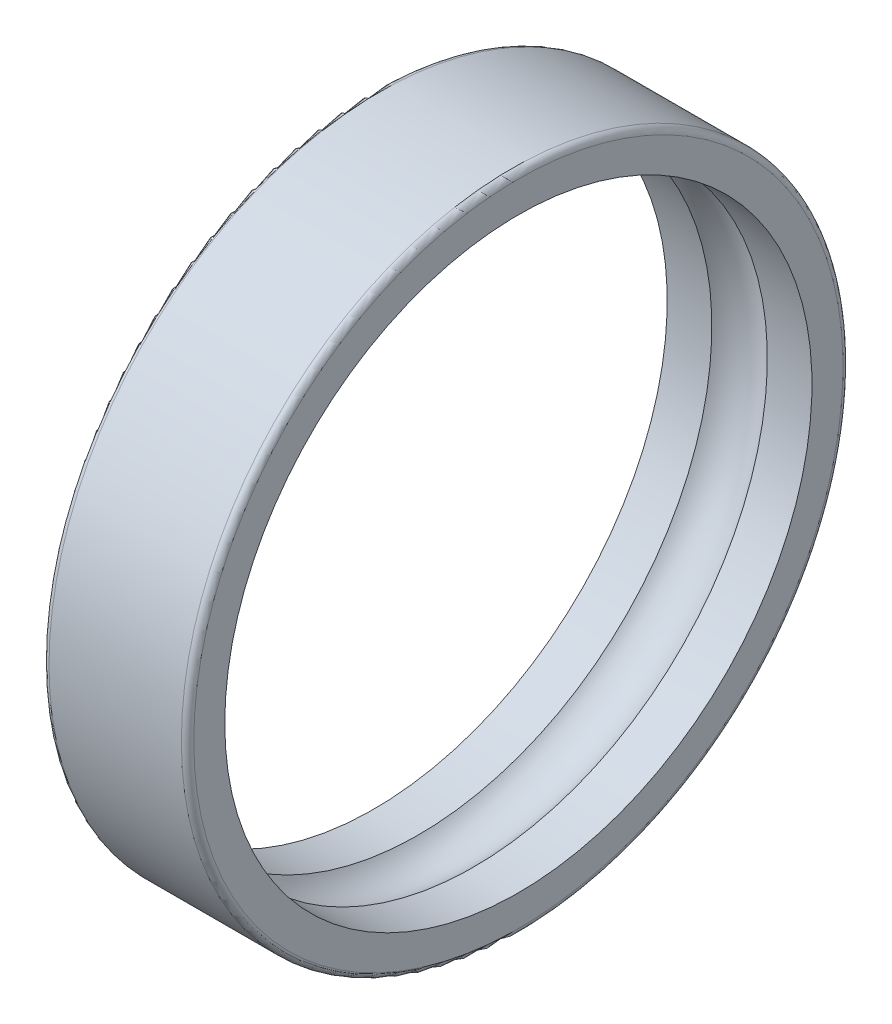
from build123d import *


with BuildPart() as part:
    # Esquisse1 → Base-R_volution (revolve)
    with BuildSketch(Plane(origin=(0, 0, 0), x_dir=(1, 0, 0), z_dir=(0, 1, 0)), mode=Mode.PRIVATE) as base_r_volution_sk:
        with BuildLine():
            Line((0, 15.7), (0, 14.2))
            Line((0, 14.2), (2.158359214, 14.2))
            ThreePointArc((2.158359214, 14.2), (3.5, 14.8), (4.841640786, 14.2))
            Line((4.841640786, 14.2), (7, 14.2))
            Line((7, 14.2), (7, 15.7))
            ThreePointArc((7, 15.7), (6.912132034, 15.912132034), (6.7, 16))
            Line((6.7, 16), (0.3, 16))
            ThreePointArc((0.3, 16), (0.087867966, 15.912132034), (0, 15.7))
        make_face()
    revolve(base_r_volution_sk.sketch.rotate(Axis((0, 0, 0), (1, 0, 0)), 180), axis=Axis((0, 0, 0), (1, 0, 0)))


solid = part.part
